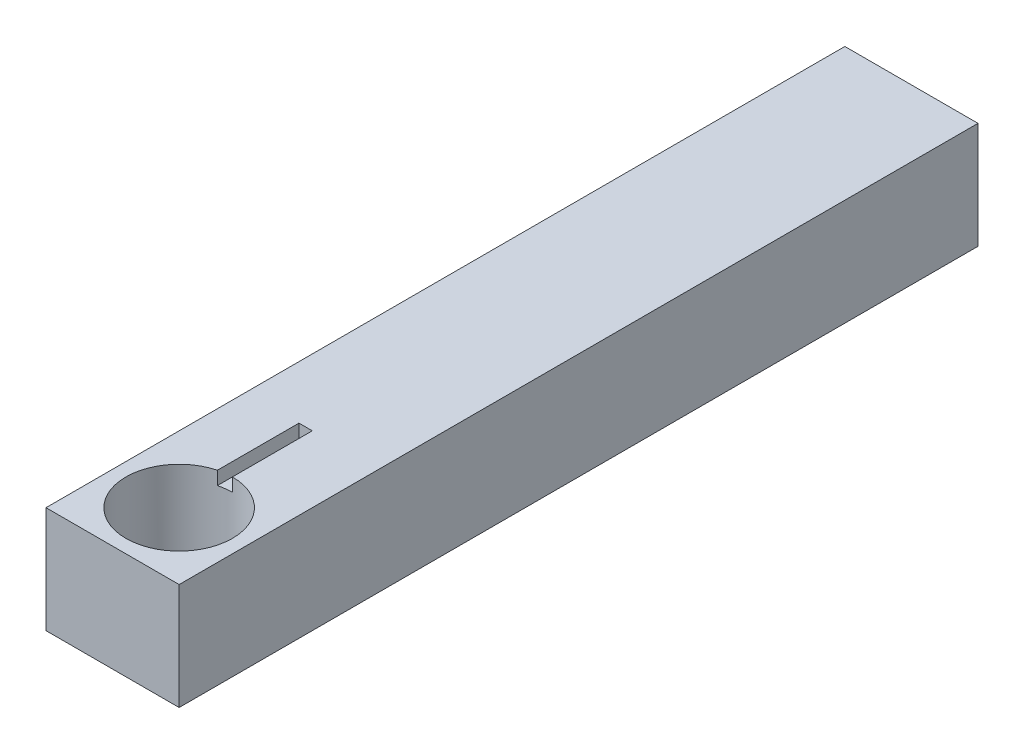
ISO-10303-21;
HEADER;
FILE_DESCRIPTION(('STEP AP214'),'2;1');
FILE_NAME('part.step','',(''),(''),'','','');
FILE_SCHEMA(('AUTOMOTIVE_DESIGN { 1 0 10303 214 1 1 1 1 }'));
ENDSEC;
DATA;
#1=APPLICATION_CONTEXT('core data for automotive mechanical design processes');
#2=APPLICATION_PROTOCOL_DEFINITION('international standard','automotive_design',2000,#1);
#3=PRODUCT_CONTEXT('',#1,'mechanical');
#4=PRODUCT('Part','Part','',(#3));
#5=PRODUCT_RELATED_PRODUCT_CATEGORY('part','',(#4));
#6=PRODUCT_DEFINITION_FORMATION('','',#4);
#7=PRODUCT_DEFINITION_CONTEXT('part definition',#1,'design');
#8=PRODUCT_DEFINITION('design','',#6,#7);
#9=PRODUCT_DEFINITION_SHAPE('','',#8);
#10=(LENGTH_UNIT() NAMED_UNIT(*) SI_UNIT(.MILLI.,.METRE.));
#11=(NAMED_UNIT(*) PLANE_ANGLE_UNIT() SI_UNIT($,.RADIAN.));
#12=(NAMED_UNIT(*) SI_UNIT($,.STERADIAN.) SOLID_ANGLE_UNIT());
#13=UNCERTAINTY_MEASURE_WITH_UNIT(LENGTH_MEASURE(1.E-05),#10,'distance_accuracy_value','');
#14=(GEOMETRIC_REPRESENTATION_CONTEXT(3) GLOBAL_UNCERTAINTY_ASSIGNED_CONTEXT((#13)) GLOBAL_UNIT_ASSIGNED_CONTEXT((#10,
#11,#12)) REPRESENTATION_CONTEXT('',''));
#15=CARTESIAN_POINT('',(0.,0.,0.));
#16=DIRECTION('',(0.,0.,1.));
#17=DIRECTION('',(1.,0.,0.));
#18=AXIS2_PLACEMENT_3D('',#15,#16,#17);
#19=CARTESIAN_POINT('',(0.,0.,300.));
#20=DIRECTION('',(1.,0.,0.));
#21=DIRECTION('',(0.,0.,-1.));
#22=AXIS2_PLACEMENT_3D('',#19,#20,#21);
#23=PLANE('',#22);
#24=DIRECTION('',(0.,-1.,0.));
#25=VECTOR('',#24,1.);
#26=CARTESIAN_POINT('',(0.,0.,0.));
#27=LINE('',#26,#25);
#28=CARTESIAN_POINT('',(0.,40.,0.));
#29=VERTEX_POINT('',#28);
#30=CARTESIAN_POINT('',(0.,0.,0.));
#31=VERTEX_POINT('',#30);
#32=EDGE_CURVE('E452',#29,#31,#27,.T.);
#33=ORIENTED_EDGE('',*,*,#32,.T.);
#34=DIRECTION('',(0.,0.,-1.));
#35=VECTOR('',#34,1.);
#36=CARTESIAN_POINT('',(0.,0.,300.));
#37=LINE('',#36,#35);
#38=CARTESIAN_POINT('',(0.,0.,300.));
#39=VERTEX_POINT('',#38);
#40=EDGE_CURVE('E477',#39,#31,#37,.T.);
#41=ORIENTED_EDGE('',*,*,#40,.F.);
#42=DIRECTION('',(0.,-1.,0.));
#43=VECTOR('',#42,1.);
#44=CARTESIAN_POINT('',(0.,0.,300.));
#45=LINE('',#44,#43);
#46=CARTESIAN_POINT('',(0.,40.,300.));
#47=VERTEX_POINT('',#46);
#48=EDGE_CURVE('E461',#47,#39,#45,.T.);
#49=ORIENTED_EDGE('',*,*,#48,.F.);
#50=DIRECTION('',(0.,0.,-1.));
#51=VECTOR('',#50,1.);
#52=CARTESIAN_POINT('',(0.,40.,300.));
#53=LINE('',#52,#51);
#54=EDGE_CURVE('E468',#47,#29,#53,.T.);
#55=ORIENTED_EDGE('',*,*,#54,.T.);
#56=EDGE_LOOP('',(#33,#41,#49,#55));
#57=FACE_BOUND('',#56,.T.);
#58=ADVANCED_FACE('F351',(#57),#23,.F.);
#59=CARTESIAN_POINT('',(0.,0.,300.));
#60=DIRECTION('',(0.,1.,0.));
#61=DIRECTION('',(0.,0.,1.));
#62=AXIS2_PLACEMENT_3D('',#59,#60,#61);
#63=PLANE('',#62);
#64=CARTESIAN_POINT('',(25.,0.,275.));
#65=DIRECTION('',(0.,1.,0.));
#66=DIRECTION('',(0.,0.,1.));
#67=AXIS2_PLACEMENT_3D('',#64,#65,#66);
#68=CIRCLE('',#67,20.);
#69=CARTESIAN_POINT('',(25.,0.,295.));
#70=VERTEX_POINT('',#69);
#71=EDGE_CURVE('E449',#70,#70,#68,.T.);
#72=ORIENTED_EDGE('',*,*,#71,.T.);
#73=EDGE_LOOP('',(#72));
#74=FACE_BOUND('',#73,.T.);
#75=DIRECTION('',(1.,0.,0.));
#76=VECTOR('',#75,1.);
#77=CARTESIAN_POINT('',(0.,0.,0.));
#78=LINE('',#77,#76);
#79=CARTESIAN_POINT('',(50.,0.,0.));
#80=VERTEX_POINT('',#79);
#81=EDGE_CURVE('E455',#31,#80,#78,.T.);
#82=ORIENTED_EDGE('',*,*,#81,.T.);
#83=DIRECTION('',(0.,0.,-1.));
#84=VECTOR('',#83,1.);
#85=CARTESIAN_POINT('',(50.,0.,300.));
#86=LINE('',#85,#84);
#87=CARTESIAN_POINT('',(50.,0.,300.));
#88=VERTEX_POINT('',#87);
#89=EDGE_CURVE('E474',#88,#80,#86,.T.);
#90=ORIENTED_EDGE('',*,*,#89,.F.);
#91=DIRECTION('',(1.,0.,0.));
#92=VECTOR('',#91,1.);
#93=CARTESIAN_POINT('',(0.,0.,300.));
#94=LINE('',#93,#92);
#95=EDGE_CURVE('E463',#39,#88,#94,.T.);
#96=ORIENTED_EDGE('',*,*,#95,.F.);
#97=ORIENTED_EDGE('',*,*,#40,.T.);
#98=EDGE_LOOP('',(#82,#90,#96,#97));
#99=FACE_BOUND('',#98,.T.);
#100=ADVANCED_FACE('F498',(#74,#99),#63,.F.);
#101=CARTESIAN_POINT('',(50.,0.,300.));
#102=DIRECTION('',(-1.,0.,0.));
#103=DIRECTION('',(0.,0.,1.));
#104=AXIS2_PLACEMENT_3D('',#101,#102,#103);
#105=PLANE('',#104);
#106=DIRECTION('',(0.,1.,0.));
#107=VECTOR('',#106,1.);
#108=CARTESIAN_POINT('',(50.,0.,0.));
#109=LINE('',#108,#107);
#110=CARTESIAN_POINT('',(50.,40.,0.));
#111=VERTEX_POINT('',#110);
#112=EDGE_CURVE('E457',#80,#111,#109,.T.);
#113=ORIENTED_EDGE('',*,*,#112,.T.);
#114=DIRECTION('',(0.,0.,-1.));
#115=VECTOR('',#114,1.);
#116=CARTESIAN_POINT('',(50.,40.,300.));
#117=LINE('',#116,#115);
#118=CARTESIAN_POINT('',(50.,40.,300.));
#119=VERTEX_POINT('',#118);
#120=EDGE_CURVE('E471',#119,#111,#117,.T.);
#121=ORIENTED_EDGE('',*,*,#120,.F.);
#122=DIRECTION('',(0.,1.,0.));
#123=VECTOR('',#122,1.);
#124=CARTESIAN_POINT('',(50.,0.,300.));
#125=LINE('',#124,#123);
#126=EDGE_CURVE('E465',#88,#119,#125,.T.);
#127=ORIENTED_EDGE('',*,*,#126,.F.);
#128=ORIENTED_EDGE('',*,*,#89,.T.);
#129=EDGE_LOOP('',(#113,#121,#127,#128));
#130=FACE_BOUND('',#129,.T.);
#131=ADVANCED_FACE('F504',(#130),#105,.F.);
#132=CARTESIAN_POINT('',(0.,40.,300.));
#133=DIRECTION('',(0.,-1.,0.));
#134=DIRECTION('',(0.,0.,-1.));
#135=AXIS2_PLACEMENT_3D('',#132,#133,#134);
#136=PLANE('',#135);
#137=DIRECTION('',(-1.,0.,0.));
#138=VECTOR('',#137,1.);
#139=CARTESIAN_POINT('',(25.,40.,225.));
#140=LINE('',#139,#138);
#141=CARTESIAN_POINT('',(25.,40.,225.));
#142=VERTEX_POINT('',#141);
#143=CARTESIAN_POINT('',(20.,40.,225.));
#144=VERTEX_POINT('',#143);
#145=EDGE_CURVE('E427',#142,#144,#140,.T.);
#146=ORIENTED_EDGE('',*,*,#145,.F.);
#147=DIRECTION('',(0.,0.,-1.));
#148=VECTOR('',#147,1.);
#149=CARTESIAN_POINT('',(25.,40.,275.));
#150=LINE('',#149,#148);
#151=CARTESIAN_POINT('',(25.,40.,255.));
#152=VERTEX_POINT('',#151);
#153=EDGE_CURVE('E417',#152,#142,#150,.T.);
#154=ORIENTED_EDGE('',*,*,#153,.F.);
#155=CARTESIAN_POINT('',(25.,40.,275.));
#156=DIRECTION('',(0.,1.,0.));
#157=DIRECTION('',(0.,0.,1.));
#158=AXIS2_PLACEMENT_3D('',#155,#156,#157);
#159=CIRCLE('',#158,20.);
#160=CARTESIAN_POINT('',(20.,40.,255.635083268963));
#161=VERTEX_POINT('',#160);
#162=EDGE_CURVE('E446',#161,#152,#159,.T.);
#163=ORIENTED_EDGE('',*,*,#162,.F.);
#164=DIRECTION('',(0.,0.,1.));
#165=VECTOR('',#164,1.);
#166=CARTESIAN_POINT('',(20.,40.,275.));
#167=LINE('',#166,#165);
#168=EDGE_CURVE('E438',#144,#161,#167,.T.);
#169=ORIENTED_EDGE('',*,*,#168,.F.);
#170=EDGE_LOOP('',(#146,#154,#163,#169));
#171=FACE_BOUND('',#170,.T.);
#172=DIRECTION('',(-1.,0.,0.));
#173=VECTOR('',#172,1.);
#174=CARTESIAN_POINT('',(0.,40.,0.));
#175=LINE('',#174,#173);
#176=EDGE_CURVE('E459',#111,#29,#175,.T.);
#177=ORIENTED_EDGE('',*,*,#176,.T.);
#178=ORIENTED_EDGE('',*,*,#54,.F.);
#179=DIRECTION('',(-1.,0.,0.));
#180=VECTOR('',#179,1.);
#181=CARTESIAN_POINT('',(0.,40.,300.));
#182=LINE('',#181,#180);
#183=EDGE_CURVE('E373',#119,#47,#182,.T.);
#184=ORIENTED_EDGE('',*,*,#183,.F.);
#185=ORIENTED_EDGE('',*,*,#120,.T.);
#186=EDGE_LOOP('',(#177,#178,#184,#185));
#187=FACE_BOUND('',#186,.T.);
#188=ADVANCED_FACE('F436',(#171,#187),#136,.F.);
#189=CARTESIAN_POINT('',(0.,40.,300.));
#190=DIRECTION('',(0.,0.,-1.));
#191=DIRECTION('',(-1.,0.,0.));
#192=AXIS2_PLACEMENT_3D('',#189,#190,#191);
#193=PLANE('',#192);
#194=ORIENTED_EDGE('',*,*,#48,.T.);
#195=ORIENTED_EDGE('',*,*,#95,.T.);
#196=ORIENTED_EDGE('',*,*,#126,.T.);
#197=ORIENTED_EDGE('',*,*,#183,.T.);
#198=EDGE_LOOP('',(#194,#195,#196,#197));
#199=FACE_BOUND('',#198,.T.);
#200=ADVANCED_FACE('F516',(#199),#193,.F.);
#201=CARTESIAN_POINT('',(0.,40.,0.));
#202=DIRECTION('',(0.,0.,-1.));
#203=DIRECTION('',(-1.,0.,0.));
#204=AXIS2_PLACEMENT_3D('',#201,#202,#203);
#205=PLANE('',#204);
#206=ORIENTED_EDGE('',*,*,#32,.F.);
#207=ORIENTED_EDGE('',*,*,#176,.F.);
#208=ORIENTED_EDGE('',*,*,#112,.F.);
#209=ORIENTED_EDGE('',*,*,#81,.F.);
#210=EDGE_LOOP('',(#206,#207,#208,#209));
#211=FACE_BOUND('',#210,.T.);
#212=ADVANCED_FACE('F511',(#211),#205,.T.);
#213=CARTESIAN_POINT('',(25.,0.,275.));
#214=DIRECTION('',(0.,1.,0.));
#215=DIRECTION('',(0.,0.,1.));
#216=AXIS2_PLACEMENT_3D('',#213,#214,#215);
#217=CYLINDRICAL_SURFACE('',#216,20.);
#218=ORIENTED_EDGE('',*,*,#162,.T.);
#219=DIRECTION('',(0.,1.,0.));
#220=VECTOR('',#219,1.);
#221=CARTESIAN_POINT('',(25.,0.,255.));
#222=LINE('',#221,#220);
#223=CARTESIAN_POINT('',(25.,35.,255.));
#224=VERTEX_POINT('',#223);
#225=EDGE_CURVE('E11',#152,#224,#222,.F.);
#226=ORIENTED_EDGE('',*,*,#225,.T.);
#227=CARTESIAN_POINT('',(25.,35.,275.));
#228=DIRECTION('',(0.,1.,0.));
#229=DIRECTION('',(0.,0.,1.));
#230=AXIS2_PLACEMENT_3D('',#227,#228,#229);
#231=CIRCLE('',#230,20.);
#232=CARTESIAN_POINT('',(20.,35.,255.635083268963));
#233=VERTEX_POINT('',#232);
#234=EDGE_CURVE('E480',#233,#224,#231,.F.);
#235=ORIENTED_EDGE('',*,*,#234,.F.);
#236=DIRECTION('',(0.,1.,0.));
#237=VECTOR('',#236,1.);
#238=CARTESIAN_POINT('',(20.,0.,255.635083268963));
#239=LINE('',#238,#237);
#240=EDGE_CURVE('E358',#233,#161,#239,.T.);
#241=ORIENTED_EDGE('',*,*,#240,.T.);
#242=EDGE_LOOP('',(#218,#226,#235,#241));
#243=FACE_BOUND('',#242,.T.);
#244=ORIENTED_EDGE('',*,*,#71,.F.);
#245=EDGE_LOOP('',(#244));
#246=FACE_BOUND('',#245,.T.);
#247=ADVANCED_FACE('F484',(#243,#246),#217,.F.);
#248=CARTESIAN_POINT('',(25.,35.,275.));
#249=DIRECTION('',(1.,0.,0.));
#250=DIRECTION('',(0.,0.,-1.));
#251=AXIS2_PLACEMENT_3D('',#248,#249,#250);
#252=PLANE('',#251);
#253=ORIENTED_EDGE('',*,*,#153,.T.);
#254=DIRECTION('',(0.,1.,0.));
#255=VECTOR('',#254,1.);
#256=CARTESIAN_POINT('',(25.,35.,225.));
#257=LINE('',#256,#255);
#258=CARTESIAN_POINT('',(25.,35.,225.));
#259=VERTEX_POINT('',#258);
#260=EDGE_CURVE('E421',#259,#142,#257,.T.);
#261=ORIENTED_EDGE('',*,*,#260,.F.);
#262=DIRECTION('',(0.,0.,-1.));
#263=VECTOR('',#262,1.);
#264=CARTESIAN_POINT('',(25.,35.,275.));
#265=LINE('',#264,#263);
#266=EDGE_CURVE('E440',#224,#259,#265,.T.);
#267=ORIENTED_EDGE('',*,*,#266,.F.);
#268=ORIENTED_EDGE('',*,*,#225,.F.);
#269=EDGE_LOOP('',(#253,#261,#267,#268));
#270=FACE_BOUND('',#269,.T.);
#271=ADVANCED_FACE('F419',(#270),#252,.F.);
#272=CARTESIAN_POINT('',(20.,35.,275.));
#273=DIRECTION('',(-1.,0.,0.));
#274=DIRECTION('',(0.,0.,1.));
#275=AXIS2_PLACEMENT_3D('',#272,#273,#274);
#276=PLANE('',#275);
#277=DIRECTION('',(0.,0.,1.));
#278=VECTOR('',#277,1.);
#279=CARTESIAN_POINT('',(20.,35.,275.));
#280=LINE('',#279,#278);
#281=CARTESIAN_POINT('',(20.,35.,225.));
#282=VERTEX_POINT('',#281);
#283=EDGE_CURVE('E365',#282,#233,#280,.T.);
#284=ORIENTED_EDGE('',*,*,#283,.F.);
#285=DIRECTION('',(0.,1.,0.));
#286=VECTOR('',#285,1.);
#287=CARTESIAN_POINT('',(20.,35.,225.));
#288=LINE('',#287,#286);
#289=EDGE_CURVE('E434',#282,#144,#288,.T.);
#290=ORIENTED_EDGE('',*,*,#289,.T.);
#291=ORIENTED_EDGE('',*,*,#168,.T.);
#292=ORIENTED_EDGE('',*,*,#240,.F.);
#293=EDGE_LOOP('',(#284,#290,#291,#292));
#294=FACE_BOUND('',#293,.T.);
#295=ADVANCED_FACE('F487',(#294),#276,.F.);
#296=CARTESIAN_POINT('',(25.,35.,225.));
#297=DIRECTION('',(0.,1.,0.));
#298=DIRECTION('',(0.,0.,1.));
#299=AXIS2_PLACEMENT_3D('',#296,#297,#298);
#300=PLANE('',#299);
#301=ORIENTED_EDGE('',*,*,#234,.T.);
#302=ORIENTED_EDGE('',*,*,#266,.T.);
#303=DIRECTION('',(-1.,0.,0.));
#304=VECTOR('',#303,1.);
#305=CARTESIAN_POINT('',(25.,35.,225.));
#306=LINE('',#305,#304);
#307=EDGE_CURVE('E433',#259,#282,#306,.T.);
#308=ORIENTED_EDGE('',*,*,#307,.T.);
#309=ORIENTED_EDGE('',*,*,#283,.T.);
#310=EDGE_LOOP('',(#301,#302,#308,#309));
#311=FACE_BOUND('',#310,.T.);
#312=ADVANCED_FACE('F488',(#311),#300,.T.);
#313=CARTESIAN_POINT('',(25.,35.,225.));
#314=DIRECTION('',(0.,0.,-1.));
#315=DIRECTION('',(-1.,0.,0.));
#316=AXIS2_PLACEMENT_3D('',#313,#314,#315);
#317=PLANE('',#316);
#318=ORIENTED_EDGE('',*,*,#145,.T.);
#319=ORIENTED_EDGE('',*,*,#289,.F.);
#320=ORIENTED_EDGE('',*,*,#307,.F.);
#321=ORIENTED_EDGE('',*,*,#260,.T.);
#322=EDGE_LOOP('',(#318,#319,#320,#321));
#323=FACE_BOUND('',#322,.T.);
#324=ADVANCED_FACE('F431',(#323),#317,.F.);
#325=CLOSED_SHELL('',(#58,#100,#131,#188,#200,#212,#247,#271,#295,#312,#324));
#326=MANIFOLD_SOLID_BREP('B2',#325);
#327=ADVANCED_BREP_SHAPE_REPRESENTATION('',(#18,#326),#14);
#328=SHAPE_DEFINITION_REPRESENTATION(#9,#327);
ENDSEC;
END-ISO-10303-21;
